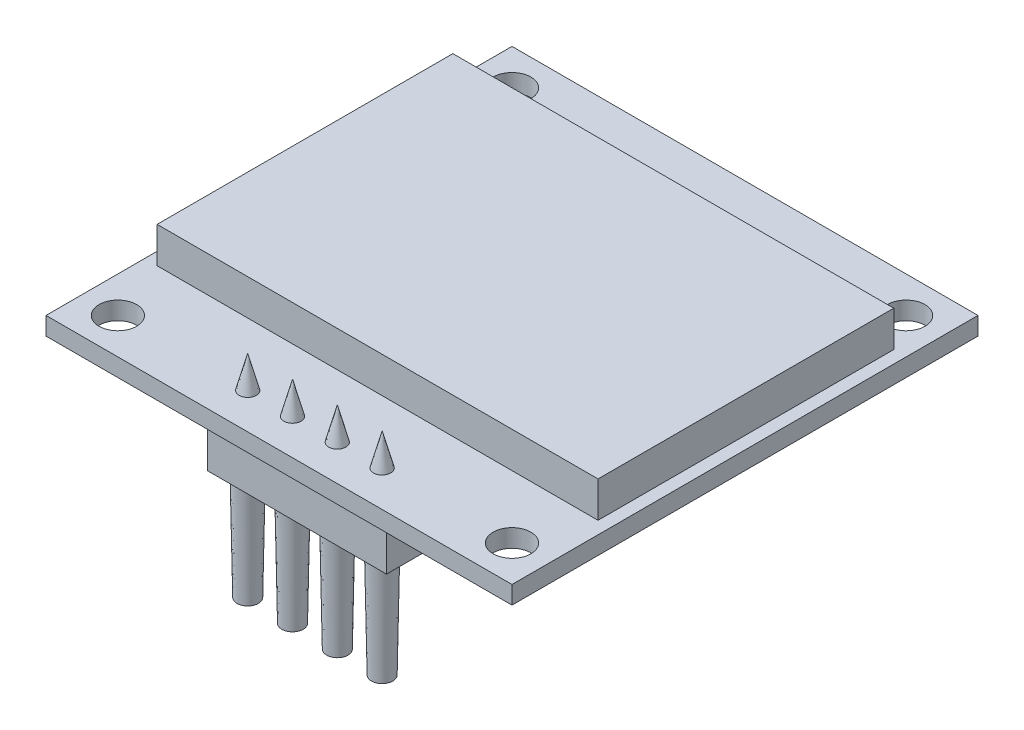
from build123d import *

# Parameters (mm, degrees)
SCHIZZO1_W                             = 26
SCHIZZO1_H                             = 26
SCHIZZO1_R                             = 1.05
ESTRUSIONE_ESTRUSIONE1_DEPTH           = 1
SCHIZZO1_3_W                           = 24.6
SCHIZZO1_3_H                           = 16.5
ESTRUSIONE_ESTRUSIONE2_DEPTH           = 3
SCHIZZO3_W                             = 10
SCHIZZO3_H                             = 2
ESTRUSIONE_ESTRUSIONE4_DEPTH           = 3
SCHIZZO1_5_R                           = 0.75
ESTRUSIONE_ESTRUSIONE5_DEPTH           = 9
ESTRUSIONE_ESTRUSIONE5_DRAFT           = -1
ESTRUSIONE_ESTRUSIONE5_PROFILE_2_DEPTH = 9
ESTRUSIONE_ESTRUSIONE5_PROFILE_2_DRAFT = -1
ESTRUSIONE_ESTRUSIONE5_PROFILE_3_DEPTH = 9
ESTRUSIONE_ESTRUSIONE5_PROFILE_3_DRAFT = -1
ESTRUSIONE_ESTRUSIONE5_PROFILE_4_DEPTH = 9
ESTRUSIONE_ESTRUSIONE5_PROFILE_4_DRAFT = -1


with BuildPart() as part:
    # Schizzo1 → Estrusione-Estrusione1 (new body)
    with BuildSketch(Plane(origin=(0, 0, 0), x_dir=(1, 0, 0), z_dir=(0, 1, 0))):
        Rectangle(SCHIZZO1_W, SCHIZZO1_H)
        with Locations(Location((10.995510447, 10.995510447, 0), (0, 0, 270))):
            Circle(SCHIZZO1_R, mode=Mode.SUBTRACT)
        with Locations(Location((10.995510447, -10.995510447, 0), (0, 0, 270))):
            Circle(SCHIZZO1_R, mode=Mode.SUBTRACT)
        with Locations(Location((-10.995510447, -10.995510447, 0), (0, 0, 270))):
            Circle(SCHIZZO1_R, mode=Mode.SUBTRACT)
        with Locations(Location((-10.995510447, 10.995510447, 0), (0, 0, 270))):
            Circle(SCHIZZO1_R, mode=Mode.SUBTRACT)
    extrude(amount=ESTRUSIONE_ESTRUSIONE1_DEPTH)


with BuildPart() as body_2:
    # Schizzo1_3 → Estrusione-Estrusione2 (new body)
    with BuildSketch(Plane(origin=(0, 0, 0), x_dir=(1, 0, 0), z_dir=(0, 1, 0))):
        with Locations((0, 0.75)):
            Rectangle(SCHIZZO1_3_W, SCHIZZO1_3_H)
    extrude(amount=ESTRUSIONE_ESTRUSIONE2_DEPTH)


with BuildPart() as body_3:
    # Estrusione-Estrusione3 cone 1 section (on through the dimple's axis) → Estrusione-Estrusione3 (revolve)
    with BuildSketch(Plane(origin=(-3.75, 0, 10.995510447), x_dir=(0, 0, -1), z_dir=(1, 0, 0))):
        Polygon((0, 0), (0.75, 0), (0, 2.799038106), align=None)
    revolve(axis=Axis((-3.75, 0, 10.995510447), (0, 1, 0)))


with BuildPart() as body_4:
    # Estrusione-Estrusione3 cone 2 section (on through the dimple's axis) → Estrusione-Estrusione3 cone 2 (revolve)
    with BuildSketch(Plane(origin=(-1.25, 0, 10.995510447), x_dir=(0, 0, -1), z_dir=(1, 0, 0))):
        Polygon((0, 0), (0.75, 0), (0, 2.799038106), align=None)
    revolve(axis=Axis((-1.25, 0, 10.995510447), (0, 1, 0)))


with BuildPart() as body_5:
    # Estrusione-Estrusione3 cone 3 section (on through the dimple's axis) → Estrusione-Estrusione3 cone 3 (revolve)
    with BuildSketch(Plane(origin=(1.25, 0, 10.995510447), x_dir=(0, 0, -1), z_dir=(1, 0, 0))):
        Polygon((0, 0), (0.75, 0), (0, 2.799038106), align=None)
    revolve(axis=Axis((1.25, 0, 10.995510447), (0, 1, 0)))


with BuildPart() as body_6:
    # Estrusione-Estrusione3 cone 4 section (on through the dimple's axis) → Estrusione-Estrusione3 cone 4 (revolve)
    with BuildSketch(Plane(origin=(3.75, 0, 10.995510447), x_dir=(0, 0, -1), z_dir=(1, 0, 0))):
        Polygon((0, 0), (0.75, 0), (0, 2.799038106), align=None)
    revolve(axis=Axis((3.75, 0, 10.995510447), (0, 1, 0)))


with BuildPart() as body_7:
    # Schizzo3 → Estrusione-Estrusione4 (new body)
    with BuildSketch(Plane(origin=(0, 0, 0), x_dir=(1, 0, 0), z_dir=(0, 1, 0))):
        with Locations((0, -11)):
            Rectangle(SCHIZZO3_W, SCHIZZO3_H)
    extrude(amount=-ESTRUSIONE_ESTRUSIONE4_DEPTH)


with BuildPart() as body_8:
    # Schizzo1_5 → Estrusione-Estrusione5 (with draft: the straight prism first)
    with BuildSketch(Plane(origin=(0, 0, 0), x_dir=(1, 0, 0), z_dir=(0, 1, 0))):
        with Locations((-3.75, -10.995510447)):
            Circle(SCHIZZO1_5_R)
    extrude(amount=-ESTRUSIONE_ESTRUSIONE5_DEPTH)
    # Estrusione-Estrusione5: the draft: its side faces are tilted about the plane it starts from
    estrusione_estrusione5_sides = [body_8.faces().sort_by_distance(p)[0] for p in [
        (-4.5, -4.5, 10.995510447),
    ]]
    draft(estrusione_estrusione5_sides, Plane(origin=(0, 0, 0), x_dir=(1, 0, 0), z_dir=(0, 1, 0)), ESTRUSIONE_ESTRUSIONE5_DRAFT)


with BuildPart() as body_9:
    # Schizzo1_5 → Estrusione-Estrusione5 profile 2 (with draft: the straight prism first)
    with BuildSketch(Plane(origin=(0, 0, 0), x_dir=(1, 0, 0), z_dir=(0, 1, 0))):
        with Locations((-1.25, -10.995510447)):
            Circle(SCHIZZO1_5_R)
    extrude(amount=-ESTRUSIONE_ESTRUSIONE5_PROFILE_2_DEPTH)
    # Estrusione-Estrusione5 profile 2: the draft: its side faces are tilted about the plane it starts from
    estrusione_estrusione5_profile_2_sides = [body_9.faces().sort_by_distance(p)[0] for p in [
        (-2, -4.5, 10.995510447),
    ]]
    draft(estrusione_estrusione5_profile_2_sides, Plane(origin=(0, 0, 0), x_dir=(1, 0, 0), z_dir=(0, 1, 0)), ESTRUSIONE_ESTRUSIONE5_PROFILE_2_DRAFT)


with BuildPart() as body_10:
    # Schizzo1_5 → Estrusione-Estrusione5 profile 3 (with draft: the straight prism first)
    with BuildSketch(Plane(origin=(0, 0, 0), x_dir=(1, 0, 0), z_dir=(0, 1, 0))):
        with Locations((1.25, -10.995510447)):
            Circle(SCHIZZO1_5_R)
    extrude(amount=-ESTRUSIONE_ESTRUSIONE5_PROFILE_3_DEPTH)
    # Estrusione-Estrusione5 profile 3: the draft: its side faces are tilted about the plane it starts from
    estrusione_estrusione5_profile_3_sides = [body_10.faces().sort_by_distance(p)[0] for p in [
        (0.5, -4.5, 10.995510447),
    ]]
    draft(estrusione_estrusione5_profile_3_sides, Plane(origin=(0, 0, 0), x_dir=(1, 0, 0), z_dir=(0, 1, 0)), ESTRUSIONE_ESTRUSIONE5_PROFILE_3_DRAFT)


with BuildPart() as body_11:
    # Schizzo1_5 → Estrusione-Estrusione5 profile 4 (with draft: the straight prism first)
    with BuildSketch(Plane(origin=(0, 0, 0), x_dir=(1, 0, 0), z_dir=(0, 1, 0))):
        with Locations((3.75, -10.995510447)):
            Circle(SCHIZZO1_5_R)
    extrude(amount=-ESTRUSIONE_ESTRUSIONE5_PROFILE_4_DEPTH)
    # Estrusione-Estrusione5 profile 4: the draft: its side faces are tilted about the plane it starts from
    estrusione_estrusione5_profile_4_sides = [body_11.faces().sort_by_distance(p)[0] for p in [
        (3, -4.5, 10.995510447),
    ]]
    draft(estrusione_estrusione5_profile_4_sides, Plane(origin=(0, 0, 0), x_dir=(1, 0, 0), z_dir=(0, 1, 0)), ESTRUSIONE_ESTRUSIONE5_PROFILE_4_DRAFT)


solid = Compound([part.part, body_2.part, body_3.part, body_4.part, body_5.part, body_6.part, body_7.part, body_8.part, body_9.part, body_10.part, body_11.part])
